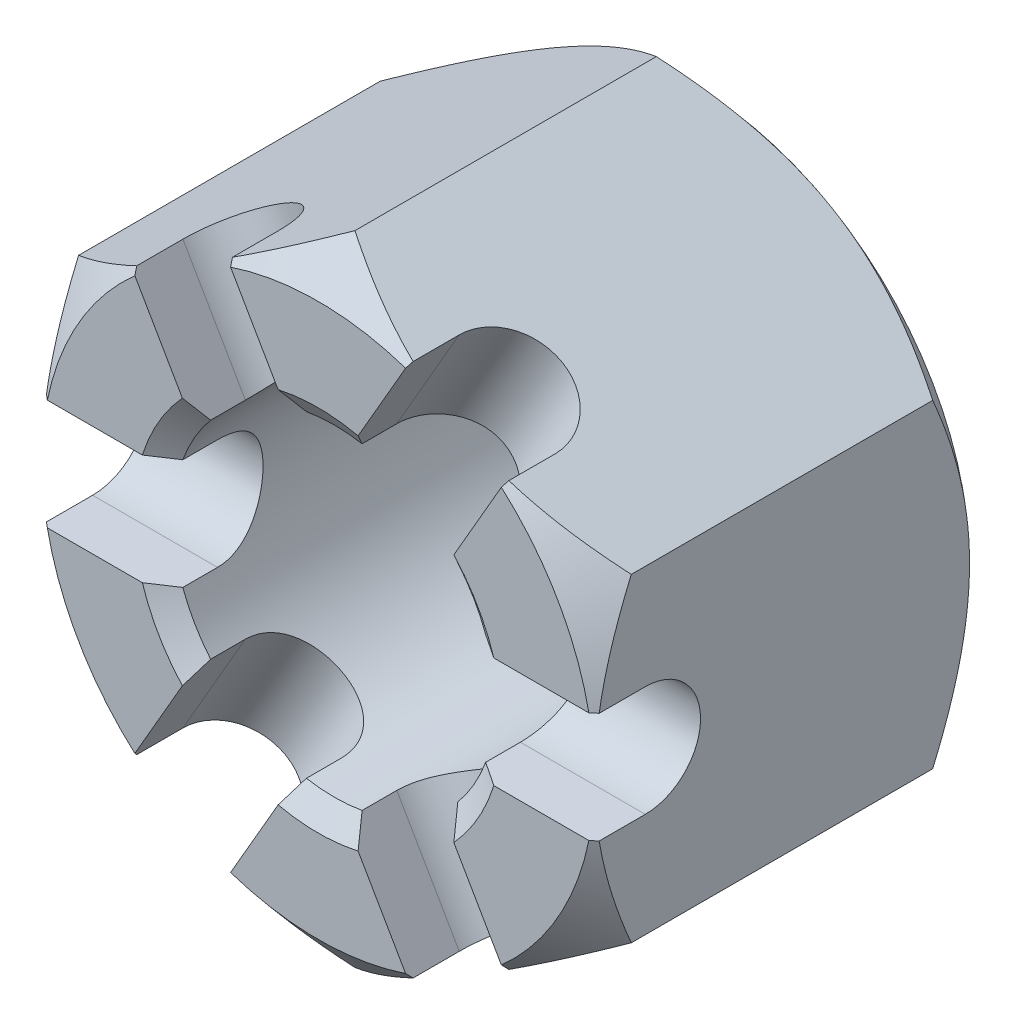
from build123d import *

# Parameters (mm, degrees)
BASENUT_START     = -25.8572
BASENUTSKE_R      = 11.1125
BASENUT_DEPTH     = 25.8572
SLOT_DEPTH        = 52.030136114
SLOTPATTERN_COUNT = 3
SLOTPATTERN_ANGLE = 120


with BuildPart() as part:
    # BaseNutSke → BaseNut (new body)
    with BuildSketch(Plane.XY.offset(BASENUT_START)):
        Polygon((19.05, 10.998522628), (19.05, -10.998522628), (0, -21.997045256), (-19.05, -10.998522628), (-19.05, 10.998522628), (0, 21.997045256), align=None)
        Circle(BASENUTSKE_R, mode=Mode.SUBTRACT)
    extrude(amount=BASENUT_DEPTH)

    # Sketch4 → Slot (cut, through all)
    with BuildSketch(Plane(origin=(19.05, 0, 0), x_dir=(0, 0, -1), z_dir=(1, 0, 0))):
        with BuildLine():
            Line((3.5052, 3.81), (0, 3.81))
            Line((0, 3.81), (0, -3.81))
            Line((0, -3.81), (3.5052, -3.81))
            ThreePointArc((3.5052, -3.81), (7.3152, 0), (3.5052, 3.81))
        make_face()
    slot = extrude(amount=-SLOT_DEPTH, mode=Mode.SUBTRACT)

    # SlotPattern: Slot ×3 about axis
    slotpattern_axis = Axis((0, 0, 0), (0, 0, 1))
    for i in range(1, SLOTPATTERN_COUNT):
        add(slot.rotate(slotpattern_axis, i * SLOTPATTERN_ANGLE / (SLOTPATTERN_COUNT - 1)), mode=Mode.SUBTRACT)

    # Sketch3 → Double-Chamfer (revolve, cut)
    with BuildSketch(Plane(origin=(0, 0, 0), x_dir=(0, 0, -1), z_dir=(1, 0, 0)), mode=Mode.PRIVATE) as double_chamfer_sk:
        Polygon((25.8572, 19.05), (23.3172, 21.997045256), (23.3172, 34.697045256), (38.5572, 34.697045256), (38.5572, 19.05), align=None)
        Polygon((2.54, 21.997045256), (2.54, 34.697045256), (-12.7, 34.697045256), (-12.7, 19.05), (0, 19.05), align=None)
    revolve(double_chamfer_sk.sketch.rotate(Axis((0, 0, 0), (0, 0, -1)), 90), axis=Axis((0, 0, 0), (0, 0, -1)), mode=Mode.SUBTRACT)

    # EndChamferSketch → EndChamfer (revolve, cut)
    with BuildSketch(Plane(origin=(0, 0, 0), x_dir=(0, 0, -1), z_dir=(1, 0, 0)), mode=Mode.PRIVATE) as endchamfer_sk:
        Polygon((25.8318, 12.7), (24.609062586, 10.95375), (25.8826, 10.95375), (25.8826, 12.7), align=None)
        Polygon((-0.0508, 12.7), (0, 12.7), (1.222737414, 10.95375), (-0.0508, 10.95375), align=None)
    revolve(endchamfer_sk.sketch.rotate(Axis((0, 0, -25.037505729), (0, 0, -1)), 270), axis=Axis((0, 0, -25.037505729), (0, 0, -1)), mode=Mode.SUBTRACT)


solid = part.part
